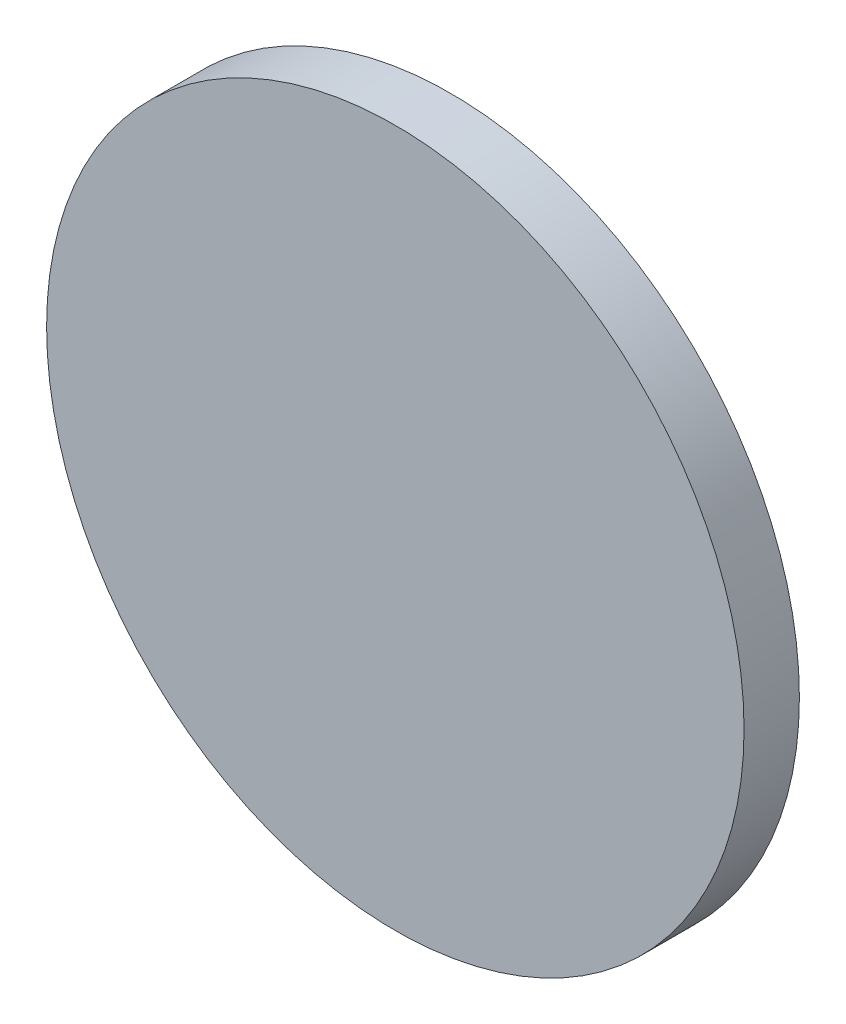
from build123d import *

# Parameters (mm, degrees)
SKETCH1_R           = 19.05
BOSS_EXTRUDE1_DEPTH = 3.0226


with BuildPart() as part:
    # Sketch1 → Boss-Extrude1 (new body)
    with BuildSketch(Plane.XY):
        Circle(SKETCH1_R)
    extrude(amount=BOSS_EXTRUDE1_DEPTH)


solid = part.part
